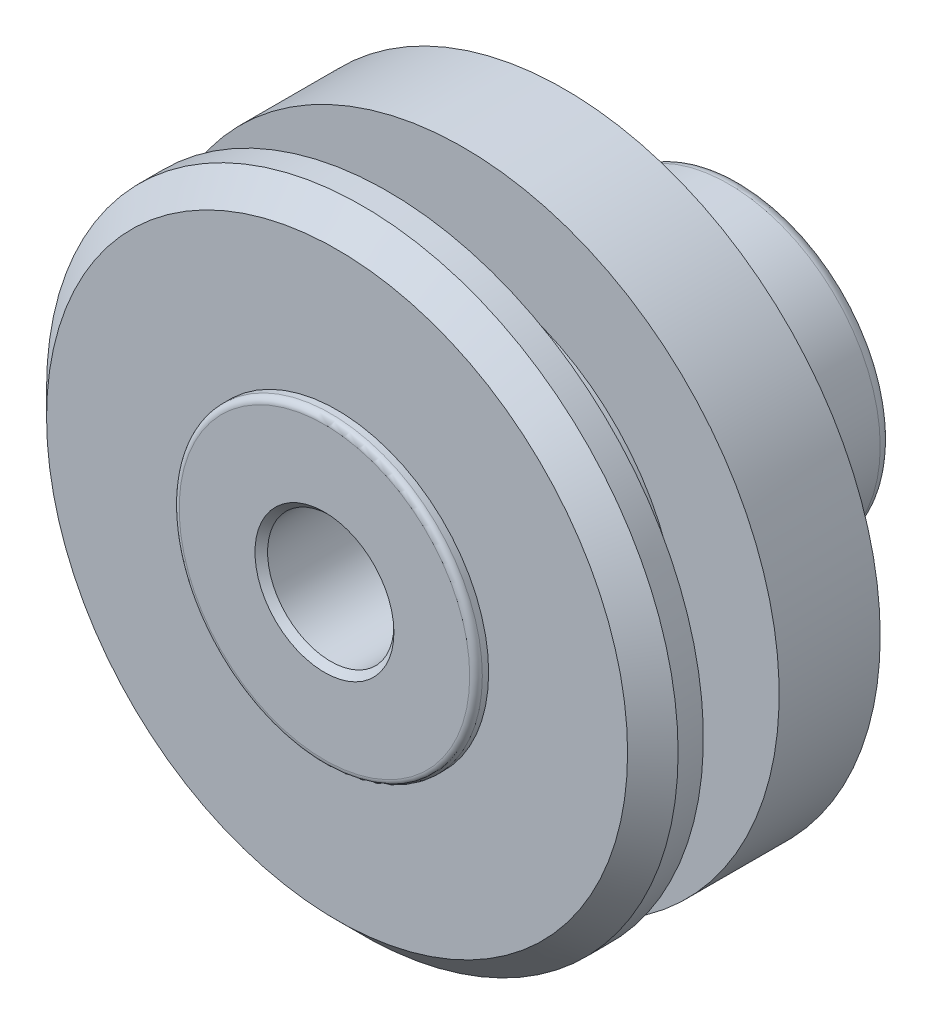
from build123d import *

# Parameters (mm, degrees)
ESQUISSE1_R             = 12.5
EXTRUSION1_DEPTH        = 9
CHANFREIN1_SIZE         = 1
ESQUISSE2_W             = 4
ESQUISSE2_H             = 3
ESQUISSE3_R             = 6
EXTRUSION2_DEPTH        = 0.5
CONG_1_R                = 0.25
ESQUISSE4_R             = 2.5
ENL_V_MAT_EXTRU_1_DEPTH = 7
ESQUISSE5_R             = 9.5
ESQUISSE5_R_2           = 6
ENL_V_MAT_EXTRU_5_DEPTH = 2.5
EXTRUSION3_START        = 7
ESQUISSE6_R             = 6
EXTRUSION3_DEPTH        = 7
CONG_2_R                = 0.5
CHANFREIN2_SIZE         = 0.25
ESQUISSE7_R             = 3
ENL_V_MAT_EXTRU_6_DEPTH = 6.5
ESQUISSE8_R             = 1.5
ENL_V_MAT_EXTRU_7_DEPTH = 21.06863224


with BuildPart() as part:
    # Esquisse1 → Extrusion1 (new body)
    with BuildSketch(Plane.XY):
        with Locations(Location((0, 0, 0), (0, 0, 180))):
            Circle(ESQUISSE1_R)
    extrude(amount=EXTRUSION1_DEPTH)

    # Chanfrein1
    chanfrein1_edges = [part.edges().sort_by_distance(p)[0] for p in [
        (12.5, 0, 9),
    ]]
    chamfer(chanfrein1_edges, length=CHANFREIN1_SIZE)

    # Esquisse2 → Enl_vement de mati_re-R_volution1 (revolve, cut)
    with BuildSketch(Plane(origin=(0, 0, 0), x_dir=(1, 0, 0), z_dir=(0, 1, 0)), mode=Mode.PRIVATE) as enl_vement_de_mati_re_r_volution1_sk:
        with Locations((10.5, -5.5)):
            Rectangle(ESQUISSE2_W, ESQUISSE2_H)
    revolve(enl_vement_de_mati_re_r_volution1_sk.sketch.rotate(Axis((0, 0, -4.459044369), (0, 0, 1)), 180), axis=Axis((0, 0, -4.459044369), (0, 0, 1)), mode=Mode.SUBTRACT)

    # Esquisse3 → Extrusion2 (add)
    with BuildSketch(Plane.XY.offset(9)):
        Circle(ESQUISSE3_R)
    extrude(amount=EXTRUSION2_DEPTH)

    # Cong_1
    cong_1_edges = [part.edges().sort_by_distance(p)[0] for p in [
        (-6, 0, 9.5),
    ]]
    fillet(cong_1_edges, radius=CONG_1_R)

    # Esquisse4 → Enl_v. mat.-Extru.1 (cut)
    with BuildSketch(Plane.XY.offset(9.5)):
        Circle(ESQUISSE4_R)
    extrude(amount=-ENL_V_MAT_EXTRU_1_DEPTH, mode=Mode.SUBTRACT)

    # Esquisse5 → Enl_v. mat.-Extru.5 (cut)
    with BuildSketch(Plane(origin=(0, 0, 0), x_dir=(-1, 0, 0), z_dir=(0, 0, -1))):
        Circle(ESQUISSE5_R)
        with Locations(Location((0, 0, 0), (0, 0, 180))):
            Circle(ESQUISSE5_R_2, mode=Mode.SUBTRACT)
    extrude(amount=-ENL_V_MAT_EXTRU_5_DEPTH, mode=Mode.SUBTRACT)

    # Esquisse6 → Extrusion3 (add)
    with BuildSketch(Plane(origin=(0, 0, 0), x_dir=(-1, 0, 0), z_dir=(0, 0, -1)).offset(EXTRUSION3_START)):
        with Locations(Location((0, 0, 0), (0, 0, 180))):
            Circle(ESQUISSE6_R)
    extrude(amount=-EXTRUSION3_DEPTH)

    # Cong_2
    cong_2_edges = [part.edges().sort_by_distance(p)[0] for p in [
        (-6, 0, -7),
    ]]
    fillet(cong_2_edges, radius=CONG_2_R)

    # Chanfrein2
    chanfrein2_edges = [part.edges().sort_by_distance(p)[0] for p in [
        (-2.5, 0, 9.5),
    ]]
    chamfer(chanfrein2_edges, length=CHANFREIN2_SIZE)

    # Esquisse7 → Enl_v. mat.-Extru.6 (cut)
    with BuildSketch(Plane(origin=(0, 0, -7), x_dir=(-1, 0, 0), z_dir=(0, 0, -1))):
        Circle(ESQUISSE7_R)
    extrude(amount=-ENL_V_MAT_EXTRU_6_DEPTH, mode=Mode.SUBTRACT)

    # Esquisse8 → Enl_v. mat.-Extru.7 (cut, through all)
    with BuildSketch(Plane.XY.offset(2.5)):
        Circle(ESQUISSE8_R)
    extrude(amount=-ENL_V_MAT_EXTRU_7_DEPTH, mode=Mode.SUBTRACT)


solid = part.part
